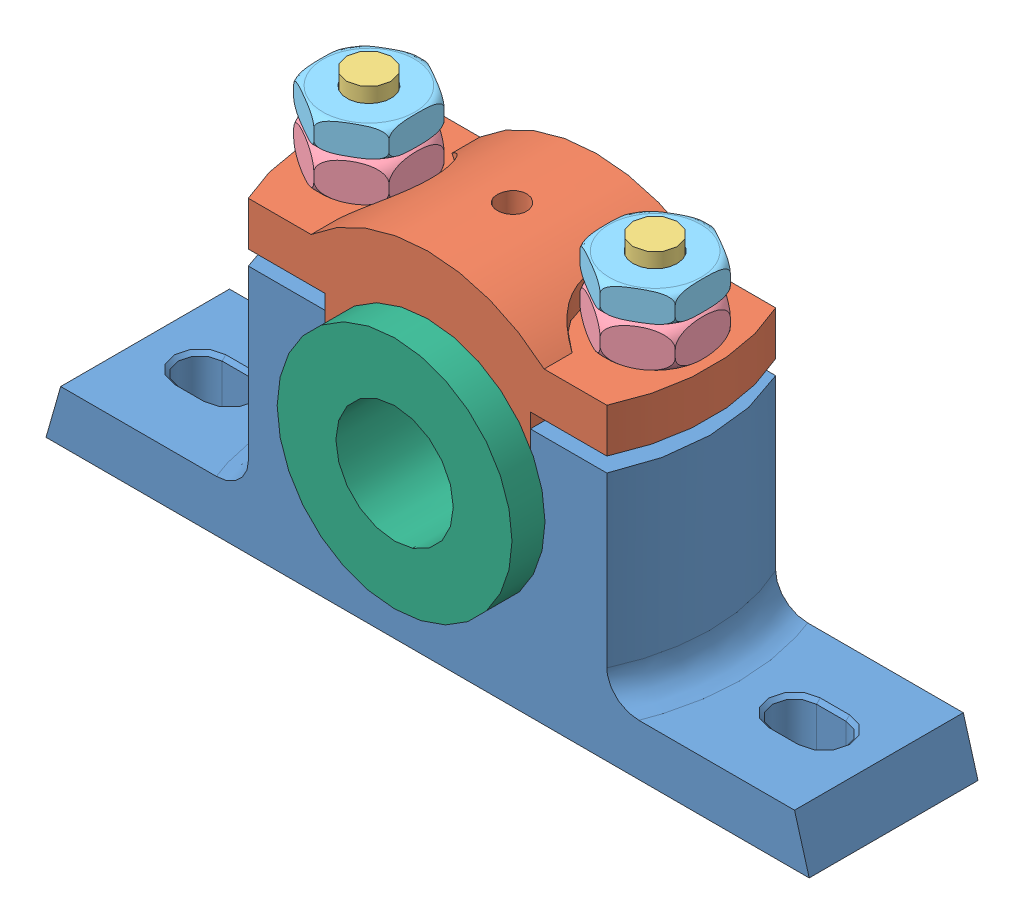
SolidWorks assembly plummer block.SLDASM, configuration Default (file format 6000). Lengths in mm.
Overall size (208 108 64).
9 component instances, 6 part files, 23 mates.
Components (placement in the parent):
- casting-1: casting.SLDPRT [Default] at origin size (208 68 46)
- cap-1: cap.SLDPRT [Default] at (0 48 0) size (108 40 46)
- bolt-1: bolt.SLDPRT [Default] at (-39 12 0) x (0 0 1) z (-1 0 0) size (26.18 105 26.18)
- nut-1: nut.SLDPRT [Default] at (39 84 0) x (0.866025 0 -0.5) z (0.5 0 0.866025) size (31.62 12 27.6)
- lock nut-1: lock nut.SLDPRT [Default] at (-39 100 0) x (0.866025 0 0.5) z (-0.5 0 0.866025) size (31.3 9.54 27.28)
- brasses-1: brasses.SLDPRT [Default] at (0 48 0) x (0 0 -1) z (1 0 0) size (64 64 64)
- bolt-3: bolt.SLDPRT [Default] at (39 12 0) x (-1 0 0) z (0 0 -1) size (26.18 105 26.18)
- nut-2: nut.SLDPRT [Default] at (-39 84 0) x (0.866025 0 0.5) z (-0.5 0 0.866025) size (31.62 12 27.6)
- lock nut-2: lock nut.SLDPRT [Default] at (39 100 0) x (0 0 -1) z (1 0 0) size (31.3 9.54 27.28)
Mates (geometry in assembly coordinates):
- Concentric1: concentric anti-aligned: cylinder of casting-1 through (39 68 0) axis (0 -1 0) radius 6; cylinder of cap-1 through (39 56 0) axis (0 1 0) radius 6
- Concentric3: concentric anti-aligned: cylinder of casting-1 through (0 48 23) axis (0 0 -1) radius 24; cylinder of brasses-1 through (0 48 34.2237) axis (0 0 1) radius 22
- Concentric4: concentric aligned: cylinder of casting-1 through (0 0 0) axis (0 -1 0) radius 4; cylinder of brasses-1 through (0 500048 0) axis (0 -1 0) radius 4
- Concentric5: concentric anti-aligned: cylinder of casting-1 through (-39 68 0) axis (0 -1 0) radius 6; cylinder of cap-1 through (-39 56 0) axis (0 1 0) radius 6
- Concentric7: concentric anti-aligned: cylinder of cap-1 through (0 48 23) axis (0 0 -1) radius 24; cylinder of brasses-1 through (0 48 34.2237) axis (0 0 1) radius 24
- Concentric8: concentric anti-aligned: cylinder of cap-1 through (-39 56 0) axis (0 1 0) radius 6; cylinder of bolt-1 through (-39 108 0) axis (0 -1 0) radius 6
- Coincident9: coincident anti-aligned: plane of casting-1 through (-26 12 -13) normal (0 -1 0); plane of bolt-1 through (-51 12 -12) normal (0 1 0)
- Concentric10: concentric anti-aligned: cylinder of cap-1 through (39 56 0) axis (0 1 0) radius 6; cylinder of bolt-3 through (39 108 0) axis (0 -1 0) radius 6
- Parallel1: parallel anti-aligned: plane of casting-1 through (26 12 13) normal (1 0 0); plane of bolt-3 through (27 4 12) normal (-1 0 0)
- Coincident10: coincident anti-aligned: plane of casting-1 through (26 12 -13) normal (0 -1 0); unknown of bolt-3
- Parallel3: parallel anti-aligned: plane of casting-1 through (-52 12 13) normal (1 0 0); plane of bolt-1 through (-51 4 -12) normal (-1 0 0)
- Concentric11: concentric aligned: cylinder of nut-1 through (39 96 0) axis (0 -1 0) radius 6; cylinder of bolt-3 through (39 108 0) axis (0 -1 0) radius 6
- Coincident11: coincident anti-aligned: plane of cap-1 through (54 84 23) normal (0 1 0); plane of nut-1 through (51.9904 84 -22.5) normal (0 -1 0)
- Concentric12: concentric aligned: cylinder of bolt-3 through (39 108 0) axis (0 -1 0) radius 6; cylinder of lock nut-2 through (39 104 0) axis (0 -1 0) radius 6
- Coincident12: coincident anti-aligned: plane of nut-1 through (51.9904 96 -22.5) normal (0 1 0); plane of lock nut-2 through (26.0096 96 -22.5) normal (0 -1 0)
- Parallel4: parallel aligned: plane of nut-1 through (51.9904 96 7.5) normal (1 0 0)
- Parallel5: parallel aligned: plane of lock nut-2 through (51.9904 104 7.5) normal (1 0 0)
- Concentric13: concentric aligned: cylinder of bolt-1 through (-39 108 0) axis (0 -1 0) radius 6; cylinder of nut-2 through (-39 96 0) axis (0 -1 0) radius 6
- Coincident14: coincident anti-aligned: plane of cap-1 through (-54 84 23) normal (0 1 0); plane of nut-2
- Concentric14: concentric aligned: cylinder of bolt-1 through (-39 108 0) axis (0 -1 0) radius 6; cylinder of lock nut-1 through (-39 104 0) axis (0 -1 0) radius 6
- Coincident15: coincident anti-aligned: unknown of lock nut-1; unknown of nut-2
- Parallel6: parallel anti-aligned: plane of nut-2 through (-51.9904 96 -7.5) normal (-1 0 0)
- Parallel7: parallel anti-aligned: plane of lock nut-1 through (-51.9904 104 -7.5) normal (-1 0 0)
